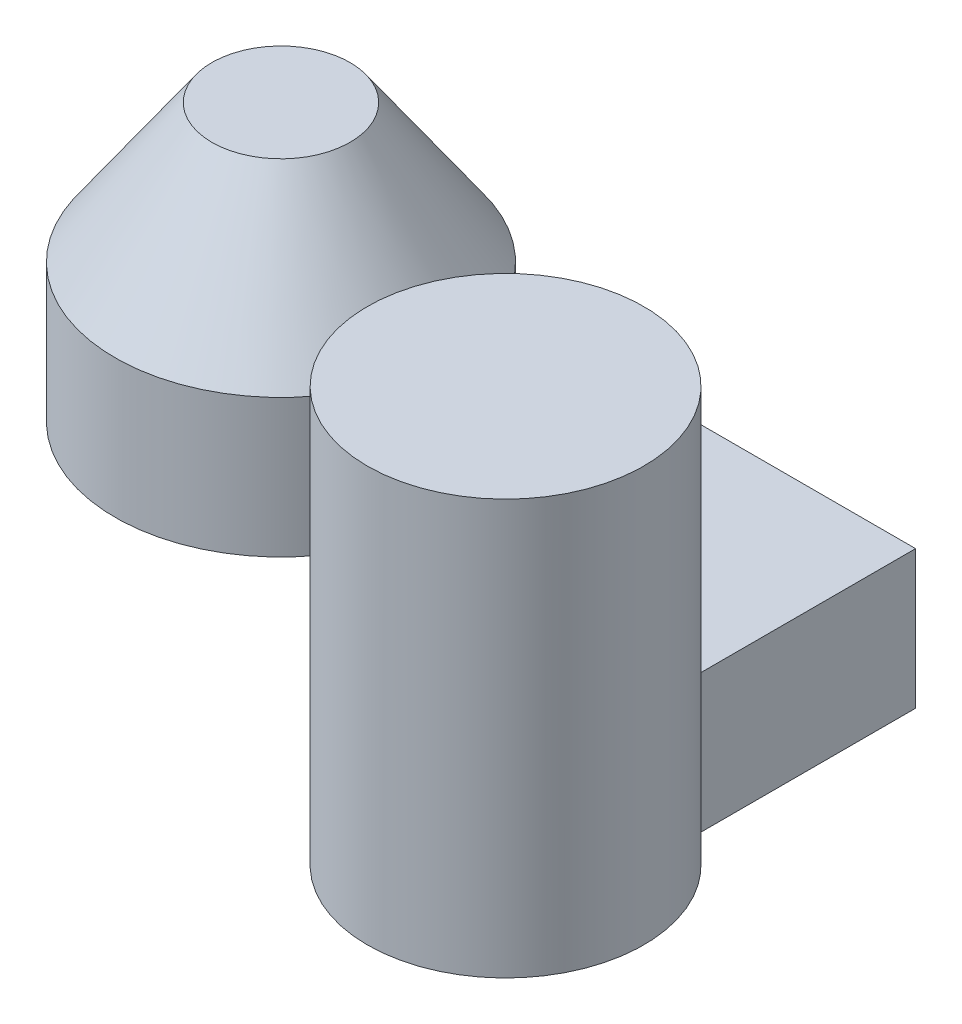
ISO-10303-21;
HEADER;
FILE_DESCRIPTION(('STEP AP214'),'2;1');
FILE_NAME('part.step','',(''),(''),'','','');
FILE_SCHEMA(('AUTOMOTIVE_DESIGN { 1 0 10303 214 1 1 1 1 }'));
ENDSEC;
DATA;
#1=APPLICATION_CONTEXT('core data for automotive mechanical design processes');
#2=APPLICATION_PROTOCOL_DEFINITION('international standard','automotive_design',2000,#1);
#3=PRODUCT_CONTEXT('',#1,'mechanical');
#4=PRODUCT('Part','Part','',(#3));
#5=PRODUCT_RELATED_PRODUCT_CATEGORY('part','',(#4));
#6=PRODUCT_DEFINITION_FORMATION('','',#4);
#7=PRODUCT_DEFINITION_CONTEXT('part definition',#1,'design');
#8=PRODUCT_DEFINITION('design','',#6,#7);
#9=PRODUCT_DEFINITION_SHAPE('','',#8);
#10=(LENGTH_UNIT() NAMED_UNIT(*) SI_UNIT(.MILLI.,.METRE.));
#11=(NAMED_UNIT(*) PLANE_ANGLE_UNIT() SI_UNIT($,.RADIAN.));
#12=(NAMED_UNIT(*) SI_UNIT($,.STERADIAN.) SOLID_ANGLE_UNIT());
#13=UNCERTAINTY_MEASURE_WITH_UNIT(LENGTH_MEASURE(1.E-05),#10,'distance_accuracy_value','');
#14=(GEOMETRIC_REPRESENTATION_CONTEXT(3) GLOBAL_UNCERTAINTY_ASSIGNED_CONTEXT((#13)) GLOBAL_UNIT_ASSIGNED_CONTEXT((#10,
#11,#12)) REPRESENTATION_CONTEXT('',''));
#15=CARTESIAN_POINT('',(0.,0.,0.));
#16=DIRECTION('',(0.,0.,1.));
#17=DIRECTION('',(1.,0.,0.));
#18=AXIS2_PLACEMENT_3D('',#15,#16,#17);
#19=CARTESIAN_POINT('',(0.,5.,2.5));
#20=DIRECTION('',(0.,1.,0.));
#21=DIRECTION('',(0.,0.,1.));
#22=AXIS2_PLACEMENT_3D('',#19,#20,#21);
#23=PLANE('',#22);
#24=CARTESIAN_POINT('',(0.,5.,0.));
#25=DIRECTION('',(0.,1.,0.));
#26=DIRECTION('',(0.,0.,1.));
#27=AXIS2_PLACEMENT_3D('',#24,#25,#26);
#28=CIRCLE('',#27,2.5);
#29=CARTESIAN_POINT('',(0.,5.,2.5));
#30=VERTEX_POINT('',#29);
#31=EDGE_CURVE('E11',#30,#30,#28,.T.);
#32=ORIENTED_EDGE('',*,*,#31,.T.);
#33=EDGE_LOOP('',(#32));
#34=FACE_BOUND('',#33,.T.);
#35=ADVANCED_FACE('F43',(#34),#23,.T.);
#36=CARTESIAN_POINT('',(0.,5.,0.));
#37=DIRECTION('',(0.,-1.,0.));
#38=DIRECTION('',(0.,0.,-1.));
#39=AXIS2_PLACEMENT_3D('',#36,#37,#38);
#40=CONICAL_SURFACE('',#39,2.5,0.610725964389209);
#41=CARTESIAN_POINT('',(0.,0.,0.));
#42=DIRECTION('',(0.,1.,0.));
#43=DIRECTION('',(0.,0.,1.));
#44=AXIS2_PLACEMENT_3D('',#41,#42,#43);
#45=CIRCLE('',#44,6.);
#46=CARTESIAN_POINT('',(5.45435605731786,0.,2.5));
#47=VERTEX_POINT('',#46);
#48=CARTESIAN_POINT('',(5.45435605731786,0.,-2.5));
#49=VERTEX_POINT('',#48);
#50=EDGE_CURVE('E51',#47,#49,#45,.T.);
#51=ORIENTED_EDGE('',*,*,#50,.T.);
#52=CARTESIAN_POINT('',(0.,0.,0.));
#53=DIRECTION('',(0.,-1.,0.));
#54=DIRECTION('',(0.,0.,-1.));
#55=AXIS2_PLACEMENT_3D('',#52,#53,#54);
#56=CIRCLE('',#55,6.);
#57=EDGE_CURVE('E133',#47,#49,#56,.T.);
#58=ORIENTED_EDGE('',*,*,#57,.F.);
#59=EDGE_LOOP('',(#51,#58));
#60=FACE_BOUND('',#59,.T.);
#61=ORIENTED_EDGE('',*,*,#31,.F.);
#62=EDGE_LOOP('',(#61));
#63=FACE_BOUND('',#62,.T.);
#64=ADVANCED_FACE('F167',(#60,#63),#40,.T.);
#65=CARTESIAN_POINT('',(0.,-5.,0.));
#66=DIRECTION('',(0.,1.,0.));
#67=DIRECTION('',(0.,0.,1.));
#68=AXIS2_PLACEMENT_3D('',#65,#66,#67);
#69=CYLINDRICAL_SURFACE('',#68,6.);
#70=ORIENTED_EDGE('',*,*,#57,.T.);
#71=DIRECTION('',(0.,1.,0.));
#72=VECTOR('',#71,1.);
#73=CARTESIAN_POINT('',(5.45435605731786,-5.,-2.5));
#74=LINE('',#73,#72);
#75=CARTESIAN_POINT('',(5.45435605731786,-5.,-2.5));
#76=VERTEX_POINT('',#75);
#77=EDGE_CURVE('E160',#76,#49,#74,.T.);
#78=ORIENTED_EDGE('',*,*,#77,.F.);
#79=CARTESIAN_POINT('',(0.,-5.,0.));
#80=DIRECTION('',(0.,-1.,0.));
#81=DIRECTION('',(0.,0.,-1.));
#82=AXIS2_PLACEMENT_3D('',#79,#80,#81);
#83=CIRCLE('',#82,6.);
#84=CARTESIAN_POINT('',(5.45435605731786,-5.,2.5));
#85=VERTEX_POINT('',#84);
#86=EDGE_CURVE('E149',#85,#76,#83,.T.);
#87=ORIENTED_EDGE('',*,*,#86,.F.);
#88=DIRECTION('',(0.,1.,0.));
#89=VECTOR('',#88,1.);
#90=CARTESIAN_POINT('',(5.45435605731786,-5.,2.5));
#91=LINE('',#90,#89);
#92=EDGE_CURVE('E58',#85,#47,#91,.T.);
#93=ORIENTED_EDGE('',*,*,#92,.T.);
#94=EDGE_LOOP('',(#70,#78,#87,#93));
#95=FACE_BOUND('',#94,.T.);
#96=ADVANCED_FACE('F175',(#95),#69,.T.);
#97=CARTESIAN_POINT('',(15.4543560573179,-5.,-2.5));
#98=DIRECTION('',(0.,0.,1.));
#99=DIRECTION('',(1.,0.,0.));
#100=AXIS2_PLACEMENT_3D('',#97,#98,#99);
#101=PLANE('',#100);
#102=DIRECTION('',(1.,0.,0.));
#103=VECTOR('',#102,1.);
#104=CARTESIAN_POINT('',(15.4543560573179,0.,-2.5));
#105=LINE('',#104,#103);
#106=CARTESIAN_POINT('',(20.4543560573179,0.,-2.5));
#107=VERTEX_POINT('',#106);
#108=EDGE_CURVE('E136',#49,#107,#105,.T.);
#109=ORIENTED_EDGE('',*,*,#108,.T.);
#110=DIRECTION('',(0.,1.,0.));
#111=VECTOR('',#110,1.);
#112=CARTESIAN_POINT('',(20.4543560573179,-5.,-2.5));
#113=LINE('',#112,#111);
#114=CARTESIAN_POINT('',(20.4543560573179,-5.,-2.5));
#115=VERTEX_POINT('',#114);
#116=EDGE_CURVE('E156',#115,#107,#113,.T.);
#117=ORIENTED_EDGE('',*,*,#116,.F.);
#118=DIRECTION('',(1.,0.,0.));
#119=VECTOR('',#118,1.);
#120=CARTESIAN_POINT('',(5.45435605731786,-5.,-2.5));
#121=LINE('',#120,#119);
#122=EDGE_CURVE('E97',#76,#115,#121,.T.);
#123=ORIENTED_EDGE('',*,*,#122,.F.);
#124=ORIENTED_EDGE('',*,*,#77,.T.);
#125=EDGE_LOOP('',(#109,#117,#123,#124));
#126=FACE_BOUND('',#125,.T.);
#127=ADVANCED_FACE('F174',(#126),#101,.F.);
#128=CARTESIAN_POINT('',(20.4543560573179,-5.,-2.5));
#129=DIRECTION('',(-1.,0.,0.));
#130=DIRECTION('',(0.,0.,1.));
#131=AXIS2_PLACEMENT_3D('',#128,#129,#130);
#132=PLANE('',#131);
#133=DIRECTION('',(0.,0.,1.));
#134=VECTOR('',#133,1.);
#135=CARTESIAN_POINT('',(20.4543560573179,0.,-2.5));
#136=LINE('',#135,#134);
#137=CARTESIAN_POINT('',(20.4543560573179,0.,5.5));
#138=VERTEX_POINT('',#137);
#139=EDGE_CURVE('E140',#107,#138,#136,.T.);
#140=ORIENTED_EDGE('',*,*,#139,.T.);
#141=DIRECTION('',(0.,1.,0.));
#142=VECTOR('',#141,1.);
#143=CARTESIAN_POINT('',(20.4543560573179,-5.,5.5));
#144=LINE('',#143,#142);
#145=CARTESIAN_POINT('',(20.4543560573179,-5.,5.5));
#146=VERTEX_POINT('',#145);
#147=EDGE_CURVE('E123',#146,#138,#144,.T.);
#148=ORIENTED_EDGE('',*,*,#147,.F.);
#149=DIRECTION('',(0.,0.,1.));
#150=VECTOR('',#149,1.);
#151=CARTESIAN_POINT('',(20.4543560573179,-5.,-2.5));
#152=LINE('',#151,#150);
#153=EDGE_CURVE('E111',#115,#146,#152,.T.);
#154=ORIENTED_EDGE('',*,*,#153,.F.);
#155=ORIENTED_EDGE('',*,*,#116,.T.);
#156=EDGE_LOOP('',(#140,#148,#154,#155));
#157=FACE_BOUND('',#156,.T.);
#158=ADVANCED_FACE('F182',(#157),#132,.F.);
#159=CARTESIAN_POINT('',(17.9543560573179,-5.,9.83012701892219));
#160=DIRECTION('',(0.,1.,0.));
#161=DIRECTION('',(0.,0.,1.));
#162=AXIS2_PLACEMENT_3D('',#159,#160,#161);
#163=CYLINDRICAL_SURFACE('',#162,5.);
#164=ORIENTED_EDGE('',*,*,#147,.T.);
#165=CARTESIAN_POINT('',(17.9543560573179,0.,9.83012701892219));
#166=DIRECTION('',(0.,1.,0.));
#167=DIRECTION('',(0.,0.,1.));
#168=AXIS2_PLACEMENT_3D('',#165,#166,#167);
#169=CIRCLE('',#168,5.);
#170=CARTESIAN_POINT('',(15.4543560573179,0.,5.5));
#171=VERTEX_POINT('',#170);
#172=EDGE_CURVE('E121',#138,#171,#169,.T.);
#173=ORIENTED_EDGE('',*,*,#172,.T.);
#174=DIRECTION('',(0.,1.,0.));
#175=VECTOR('',#174,1.);
#176=CARTESIAN_POINT('',(15.4543560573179,-5.,5.5));
#177=LINE('',#176,#175);
#178=CARTESIAN_POINT('',(15.4543560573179,-5.,5.5));
#179=VERTEX_POINT('',#178);
#180=EDGE_CURVE('E118',#179,#171,#177,.T.);
#181=ORIENTED_EDGE('',*,*,#180,.F.);
#182=CARTESIAN_POINT('',(17.9543560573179,-5.,9.83012701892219));
#183=DIRECTION('',(0.,-1.,0.));
#184=DIRECTION('',(0.,0.,-1.));
#185=AXIS2_PLACEMENT_3D('',#182,#183,#184);
#186=CIRCLE('',#185,5.);
#187=EDGE_CURVE('E105',#146,#179,#186,.T.);
#188=ORIENTED_EDGE('',*,*,#187,.F.);
#189=EDGE_LOOP('',(#164,#173,#181,#188));
#190=FACE_BOUND('',#189,.T.);
#191=CARTESIAN_POINT('',(17.9543560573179,10.,9.83012701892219));
#192=DIRECTION('',(0.,1.,0.));
#193=DIRECTION('',(0.,0.,1.));
#194=AXIS2_PLACEMENT_3D('',#191,#192,#193);
#195=CIRCLE('',#194,5.);
#196=CARTESIAN_POINT('',(17.9543560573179,10.,14.8301270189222));
#197=VERTEX_POINT('',#196);
#198=EDGE_CURVE('E137',#197,#197,#195,.T.);
#199=ORIENTED_EDGE('',*,*,#198,.F.);
#200=EDGE_LOOP('',(#199));
#201=FACE_BOUND('',#200,.T.);
#202=ADVANCED_FACE('F119',(#190,#201),#163,.T.);
#203=CARTESIAN_POINT('',(15.4543560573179,-5.,2.5));
#204=DIRECTION('',(1.,0.,0.));
#205=DIRECTION('',(0.,0.,-1.));
#206=AXIS2_PLACEMENT_3D('',#203,#204,#205);
#207=PLANE('',#206);
#208=DIRECTION('',(0.,0.,-1.));
#209=VECTOR('',#208,1.);
#210=CARTESIAN_POINT('',(15.4543560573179,0.,2.5));
#211=LINE('',#210,#209);
#212=CARTESIAN_POINT('',(15.4543560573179,0.,2.5));
#213=VERTEX_POINT('',#212);
#214=EDGE_CURVE('E88',#171,#213,#211,.T.);
#215=ORIENTED_EDGE('',*,*,#214,.T.);
#216=DIRECTION('',(0.,1.,0.));
#217=VECTOR('',#216,1.);
#218=CARTESIAN_POINT('',(15.4543560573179,-5.,2.5));
#219=LINE('',#218,#217);
#220=CARTESIAN_POINT('',(15.4543560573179,-5.,2.5));
#221=VERTEX_POINT('',#220);
#222=EDGE_CURVE('E124',#221,#213,#219,.T.);
#223=ORIENTED_EDGE('',*,*,#222,.F.);
#224=DIRECTION('',(0.,0.,-1.));
#225=VECTOR('',#224,1.);
#226=CARTESIAN_POINT('',(15.4543560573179,-5.,2.5));
#227=LINE('',#226,#225);
#228=EDGE_CURVE('E109',#179,#221,#227,.T.);
#229=ORIENTED_EDGE('',*,*,#228,.F.);
#230=ORIENTED_EDGE('',*,*,#180,.T.);
#231=EDGE_LOOP('',(#215,#223,#229,#230));
#232=FACE_BOUND('',#231,.T.);
#233=ADVANCED_FACE('F126',(#232),#207,.F.);
#234=CARTESIAN_POINT('',(5.45435605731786,-5.,2.5));
#235=DIRECTION('',(0.,0.,-1.));
#236=DIRECTION('',(-1.,0.,0.));
#237=AXIS2_PLACEMENT_3D('',#234,#235,#236);
#238=PLANE('',#237);
#239=DIRECTION('',(-1.,0.,0.));
#240=VECTOR('',#239,1.);
#241=CARTESIAN_POINT('',(5.45435605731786,0.,2.5));
#242=LINE('',#241,#240);
#243=EDGE_CURVE('E146',#213,#47,#242,.T.);
#244=ORIENTED_EDGE('',*,*,#243,.T.);
#245=ORIENTED_EDGE('',*,*,#92,.F.);
#246=DIRECTION('',(-1.,0.,0.));
#247=VECTOR('',#246,1.);
#248=CARTESIAN_POINT('',(5.45435605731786,-5.,2.5));
#249=LINE('',#248,#247);
#250=EDGE_CURVE('E67',#221,#85,#249,.T.);
#251=ORIENTED_EDGE('',*,*,#250,.F.);
#252=ORIENTED_EDGE('',*,*,#222,.T.);
#253=EDGE_LOOP('',(#244,#245,#251,#252));
#254=FACE_BOUND('',#253,.T.);
#255=ADVANCED_FACE('F217',(#254),#238,.F.);
#256=CARTESIAN_POINT('',(0.,-5.,0.));
#257=DIRECTION('',(0.,-1.,0.));
#258=DIRECTION('',(0.,0.,-1.));
#259=AXIS2_PLACEMENT_3D('',#256,#257,#258);
#260=PLANE('',#259);
#261=ORIENTED_EDGE('',*,*,#86,.T.);
#262=ORIENTED_EDGE('',*,*,#122,.T.);
#263=ORIENTED_EDGE('',*,*,#153,.T.);
#264=ORIENTED_EDGE('',*,*,#187,.T.);
#265=ORIENTED_EDGE('',*,*,#228,.T.);
#266=ORIENTED_EDGE('',*,*,#250,.T.);
#267=EDGE_LOOP('',(#261,#262,#263,#264,#265,#266));
#268=FACE_BOUND('',#267,.T.);
#269=ADVANCED_FACE('F107',(#268),#260,.T.);
#270=CARTESIAN_POINT('',(0.,0.,0.));
#271=DIRECTION('',(0.,-1.,0.));
#272=DIRECTION('',(0.,0.,-1.));
#273=AXIS2_PLACEMENT_3D('',#270,#271,#272);
#274=PLANE('',#273);
#275=ORIENTED_EDGE('',*,*,#172,.F.);
#276=ORIENTED_EDGE('',*,*,#139,.F.);
#277=ORIENTED_EDGE('',*,*,#108,.F.);
#278=ORIENTED_EDGE('',*,*,#50,.F.);
#279=ORIENTED_EDGE('',*,*,#243,.F.);
#280=ORIENTED_EDGE('',*,*,#214,.F.);
#281=EDGE_LOOP('',(#275,#276,#277,#278,#279,#280));
#282=FACE_BOUND('',#281,.T.);
#283=ADVANCED_FACE('F171',(#282),#274,.F.);
#284=CARTESIAN_POINT('',(17.9543560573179,10.,9.83012701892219));
#285=DIRECTION('',(0.,1.,0.));
#286=DIRECTION('',(0.,0.,1.));
#287=AXIS2_PLACEMENT_3D('',#284,#285,#286);
#288=PLANE('',#287);
#289=ORIENTED_EDGE('',*,*,#198,.T.);
#290=EDGE_LOOP('',(#289));
#291=FACE_BOUND('',#290,.T.);
#292=ADVANCED_FACE('F264',(#291),#288,.T.);
#293=CLOSED_SHELL('',(#35,#64,#96,#127,#158,#202,#233,#255,#269,#283,#292));
#294=MANIFOLD_SOLID_BREP('B2',#293);
#295=ADVANCED_BREP_SHAPE_REPRESENTATION('',(#18,#294),#14);
#296=SHAPE_DEFINITION_REPRESENTATION(#9,#295);
ENDSEC;
END-ISO-10303-21;
